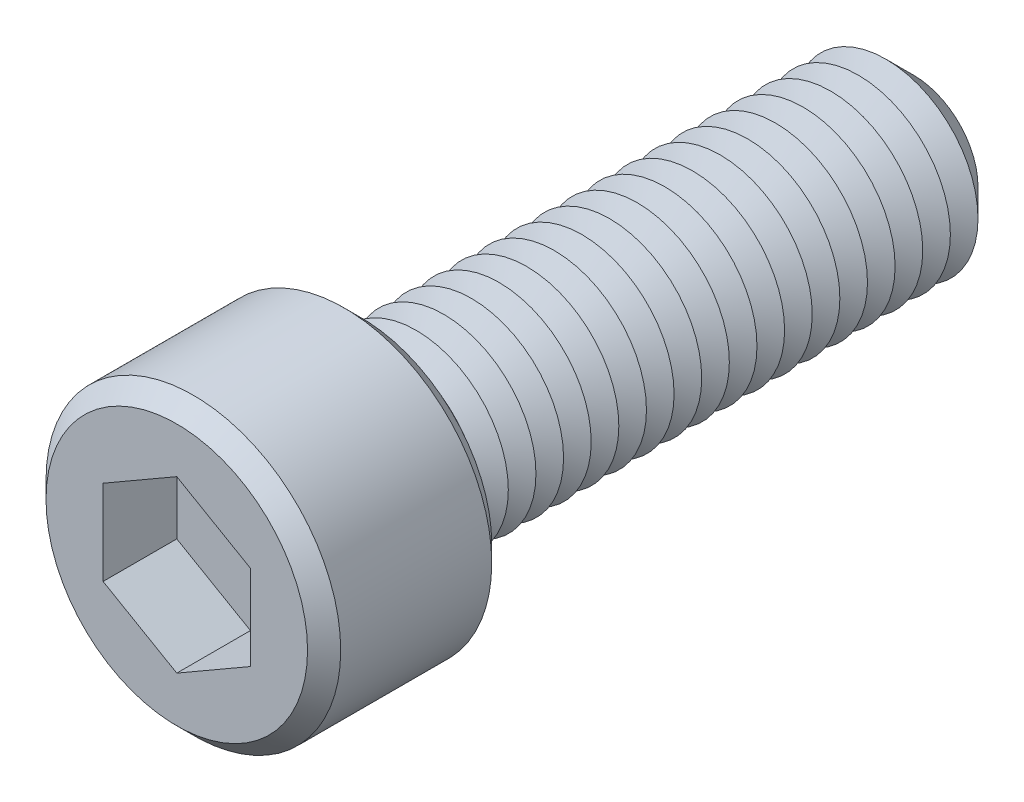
from build123d import *

# Parameters (mm, degrees)
SKETCH1_R           = 8
BOSS_EXTRUDE1_DEPTH = 10
SKETCH2_R           = 5
BOSS_EXTRUDE2_DEPTH = 30
CHAMFER1_SIZE       = 1.5
LPATTERN1_COUNT     = 19
LPATTERN1_PITCH     = 1.5
CUT_EXTRUDE1_DEPTH  = 4
SKETCH6_R           = 0.9
CUT_EXTRUDE2_DEPTH  = 36
CHAMFER2_SIZE       = 0.9


with BuildPart() as part:
    # Sketch1 → Boss-Extrude1 (new body)
    with BuildSketch(Plane.XY):
        Circle(SKETCH1_R)
    extrude(amount=BOSS_EXTRUDE1_DEPTH)

    # Sketch2 → Boss-Extrude2 (add)
    with BuildSketch(Plane(origin=(0, 0, 0), x_dir=(-1, 0, 0), z_dir=(0, 0, -1))):
        Circle(SKETCH2_R)
    extrude(amount=BOSS_EXTRUDE2_DEPTH)

    # Chamfer1
    chamfer1_edges = [part.edges().sort_by_distance(p)[0] for p in [
        (5, 0, -30),
    ]]
    chamfer(chamfer1_edges, length=CHAMFER1_SIZE)

    # Sketch4 → Cut-Revolve1 (revolve, cut)
    with BuildSketch(Plane(origin=(0, 0, 0), x_dir=(0, 0, -1), z_dir=(1, 0, 0)), mode=Mode.PRIVATE) as cut_revolve1_sk:
        Polygon((0, 5), (0.75, 3.700961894), (1.5, 5), align=None)
    cut_revolve1 = revolve(cut_revolve1_sk.sketch.rotate(Axis((0, 0, 2.512122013), (0, 0, -1)), 90), axis=Axis((0, 0, 2.512122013), (0, 0, -1)), mode=Mode.SUBTRACT)

    # LPattern1: Cut-Revolve1 ×19
    with Locations(*[(0, 0, -i * LPATTERN1_PITCH) for i in range(1, LPATTERN1_COUNT)]):
        add(cut_revolve1, mode=Mode.SUBTRACT)

    # Sketch5 → Cut-Extrude1 (cut)
    with BuildSketch(Plane.XY.offset(10)):
        Polygon((0, 4.618802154), (-4, 2.309401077), (-4, -2.309401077), (0, -4.618802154), (4, -2.309401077), (4, 2.309401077), align=None)
    extrude(amount=-CUT_EXTRUDE1_DEPTH, mode=Mode.SUBTRACT)

    # Sketch6 → Cut-Extrude2 (cut)
    with BuildSketch(Plane.XY.offset(6)):
        Circle(SKETCH6_R)
    extrude(amount=-CUT_EXTRUDE2_DEPTH, mode=Mode.SUBTRACT)

    # Chamfer2
    chamfer2_edges = [part.edges().sort_by_distance(p)[0] for p in [
        (-8, 0, 0),
        (-8, 0, 10),
    ]]
    chamfer(chamfer2_edges, length=CHAMFER2_SIZE)


solid = part.part
